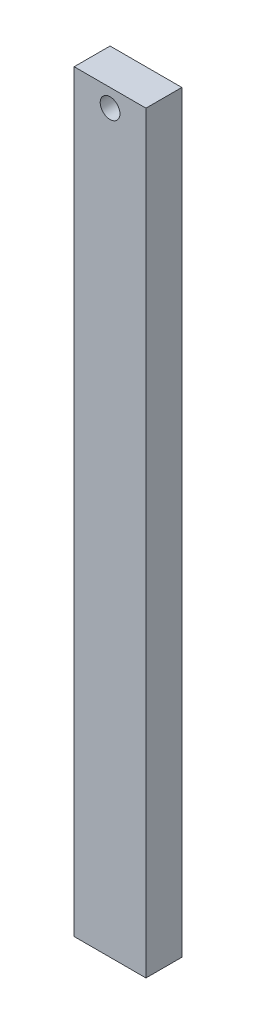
from build123d import *

# Parameters (mm, degrees)
SKETCH_1_W            = 20
SKETCH_1_H            = 210
EXTRUDE_1_DEPTH       = 10
HOLE_WIZARD_M53_D     = 4.2
HOLE_WIZARD_M53_DEPTH = 12
HOLE_WIZARD_M53_TIP   = 1.2618073
HOLE_WIZARD_M51_D     = 5.5


with BuildPart() as part:
    # Sketch 1 → Extrude 1 (new body)
    with BuildSketch(Plane.XY):
        Rectangle(SKETCH_1_W, SKETCH_1_H)
    extrude(amount=EXTRUDE_1_DEPTH)

    # Hole Wizard M53
    with Locations(Plane(origin=(0, -105, 0), x_dir=(-1, 0, 0), z_dir=(0, -1, 0))):
        with Locations((0, -5)):
            Hole(HOLE_WIZARD_M53_D / 2, depth=HOLE_WIZARD_M53_DEPTH)
            with Locations((0, 0, -(HOLE_WIZARD_M53_DEPTH + HOLE_WIZARD_M53_TIP / 2))):  # 118° drill point
                Cone(0, HOLE_WIZARD_M53_D / 2, HOLE_WIZARD_M53_TIP, mode=Mode.SUBTRACT)

    # Hole Wizard M51 (through all)
    with Locations(Plane.XY.offset(10)):
        with Locations((0, 100)):
            Hole(HOLE_WIZARD_M51_D / 2)


solid = part.part
